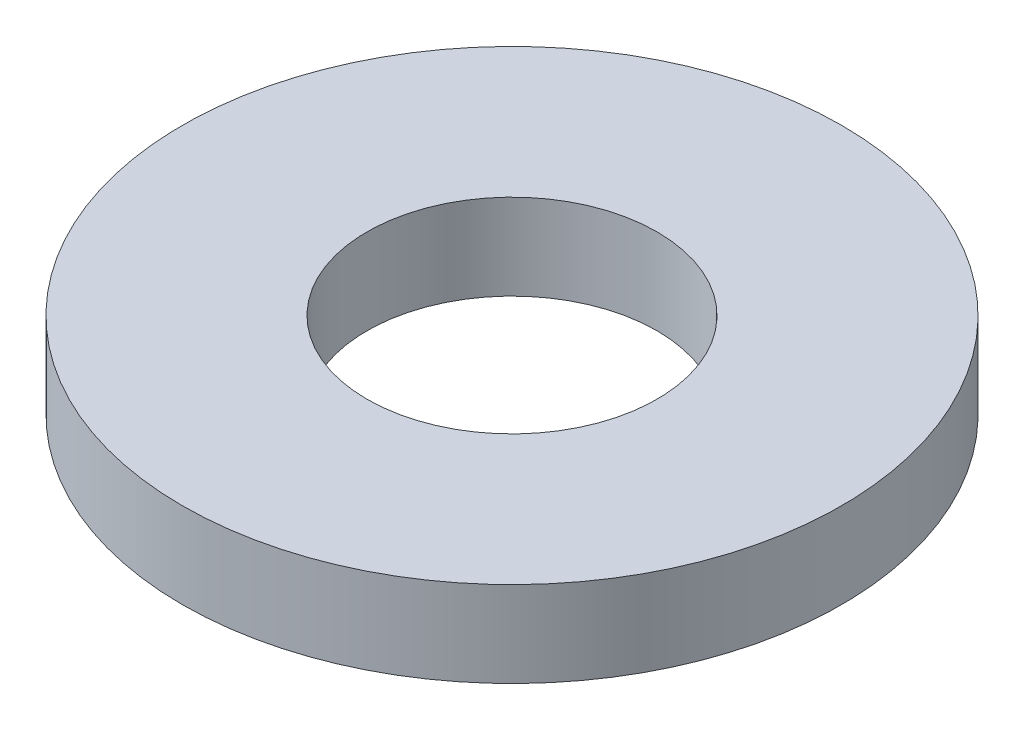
from build123d import *

# Parameters (mm, degrees)
SKETCH1_R           = 6.35
BOSS_EXTRUDE1_DEPTH = 1.651
SKETCH5_R           = 2.794
CUT_EXTRUDE1_DEPTH  = 10.13076125


with BuildPart() as part:
    # Sketch1 → Boss-Extrude1 (new body)
    with BuildSketch(Plane(origin=(0, 0, 0), x_dir=(1, 0, 0), z_dir=(0, 1, 0))):
        with Locations(Location((0, 0, 0), (0, 0, 90))):
            Circle(SKETCH1_R)
    extrude(amount=BOSS_EXTRUDE1_DEPTH)

    # Sketch5 → Cut-Extrude1 (cut, through all)
    with BuildSketch(Plane(origin=(0, 1.651, 0), x_dir=(-1, 0, 0), z_dir=(0, 1, 0))):
        with Locations(Location((0, 0, 0), (0, 0, 90))):
            Circle(SKETCH5_R)
    extrude(amount=-CUT_EXTRUDE1_DEPTH, mode=Mode.SUBTRACT)


solid = part.part
